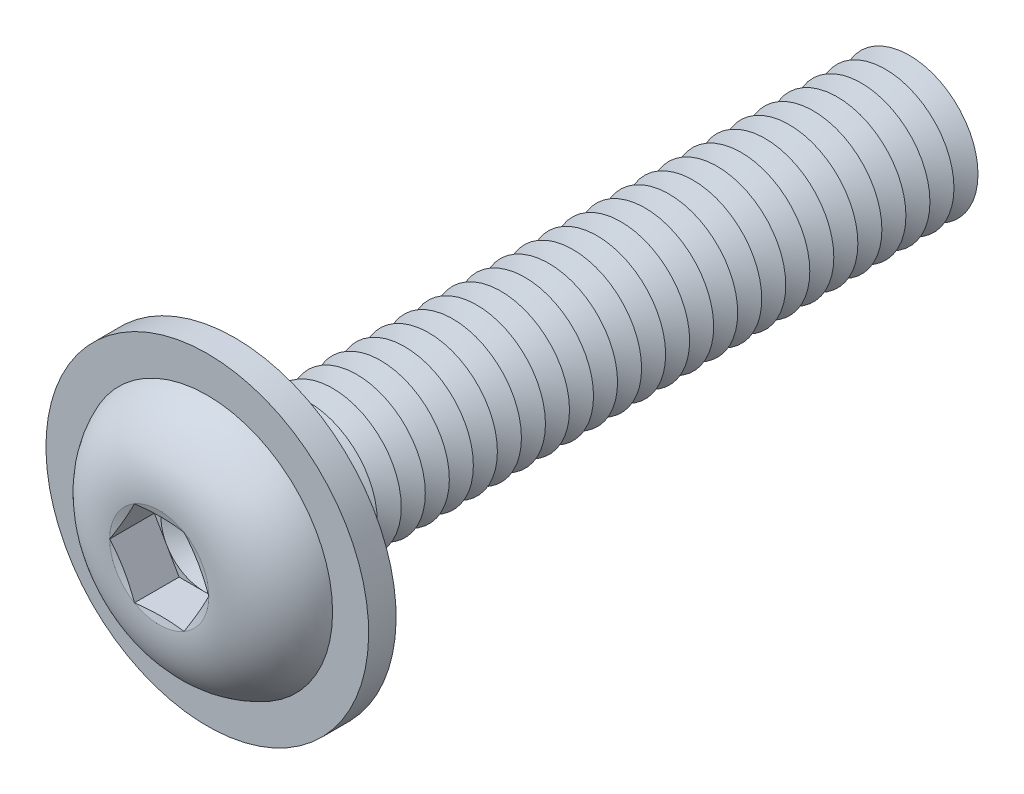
from build123d import *

# Parameters (mm, degrees)
FILLET1_R           = 0.35
LPATTERN1_COUNT     = 28
LPATTERN1_PITCH     = 0.7
CUT_EXTRUDE1_DEPTH  = 1.3
SKETCH5_R           = 4.7
SKETCH5_R_2         = 2.35
BOSS_EXTRUDE1_DEPTH = 0.8


with BuildPart() as part:
    # Sketch1 → Revolve1 (revolve)
    with BuildSketch(Plane(origin=(0, 0, 0), x_dir=(0, 0, -1), z_dir=(1, 0, 0)), mode=Mode.PRIVATE) as revolve1_sk:
        with BuildLine():
            Line((0, 2), (0, 3.8))
            ThreePointArc((0, 3.8), (-1.611961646, 3.099623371), (-2.2, 1.443375))
            Line((-2.2, 1.443375), (-2.006624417, 0.7216875))
            Line((-2.006624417, 0.7216875), (-2.2, 0.7216875))
            Line((-2.2, 0.7216875), (-2.2, 0))
            Line((-2.2, 0), (20, 0))
            Line((20, 0), (20, 2))
            Line((20, 2), (0, 2))
        make_face()
    revolve(revolve1_sk.sketch.rotate(Axis((0, 0, -20), (0, 0, 1)), 90), axis=Axis((0, 0, -20), (0, 0, 1)))

    # Fillet1
    fillet1_edges = [part.edges().sort_by_distance(p)[0] for p in [
        (2, 0, 0),
    ]]
    fillet(fillet1_edges, radius=FILLET1_R)

    # Sketch2 → Cut-Revolve1 (revolve, cut)
    with BuildSketch(Plane(origin=(0, 0, 0), x_dir=(0, 0, -1), z_dir=(1, 0, 0)), mode=Mode.PRIVATE) as cut_revolve1_sk:
        Polygon((19.65, 2), (20.35, 2), (20, 1.393782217), align=None)
    cut_revolve1 = revolve(cut_revolve1_sk.sketch.rotate(Axis((0, 0, -20), (0, 0, -1)), 270), axis=Axis((0, 0, -20), (0, 0, -1)), mode=Mode.SUBTRACT)

    # LPattern1: Cut-Revolve1 ×28
    with Locations(*[(0, 0, i * LPATTERN1_PITCH) for i in range(1, LPATTERN1_COUNT)]):
        add(cut_revolve1, mode=Mode.SUBTRACT)

    # Sketch3 → Cut-Extrude1 (cut)
    with BuildSketch(Plane.XY.offset(2.2)):
        Polygon((0.7216875, 1.249999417), (-0.7216875, 1.249999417), (-1.443375, 0), (-0.7216875, -1.249999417), (0.7216875, -1.249999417), (1.443375, 0), align=None)
    extrude(amount=-CUT_EXTRUDE1_DEPTH, mode=Mode.SUBTRACT)

    # Cut-Extrude2 cone 1 section (on through the dimple's axis) → Cut-Extrude2 (revolve, cut)
    with BuildSketch(Plane(origin=(0, 0, 0.9), x_dir=(0, -1, 0), z_dir=(1, 0, 0))):
        Polygon((0, 0), (1.249999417, 0), (0, 0.7216875), align=None)
    revolve(axis=Axis((0, 0, 0.9), (0, 0, -1)), mode=Mode.SUBTRACT)

    # Sketch5 → Boss-Extrude1 (add)
    with BuildSketch(Plane(origin=(0, 0, 0), x_dir=(-1, 0, 0), z_dir=(0, 0, -1))):
        with Locations(Location((0, 0, 0), (0, 0, 90))):
            Circle(SKETCH5_R)
        Circle(SKETCH5_R_2, mode=Mode.SUBTRACT)
    extrude(amount=-BOSS_EXTRUDE1_DEPTH)


solid = part.part
